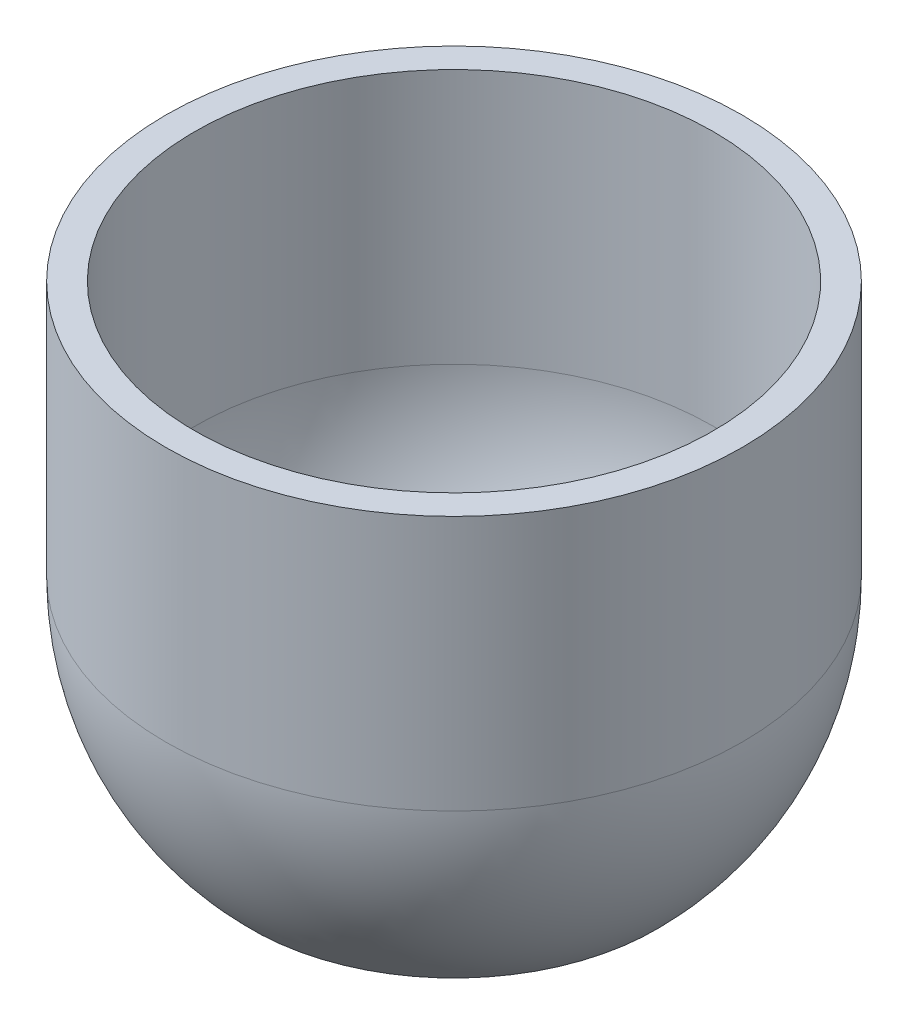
from build123d import *


with BuildPart() as part:
    # Sketch1 → Cup (revolve)
    with BuildSketch(Plane.XY, mode=Mode.PRIVATE) as cup_sk:
        with BuildLine():
            Line((0, 0), (35, 0))
            ThreePointArc((35, 0), (46.097722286, 16.342225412), (50, 35.707142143))
            Line((50, 35.707142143), (50, 80))
            Line((50, 80), (45, 80))
            Line((45, 80), (45, 35.707142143))
            ThreePointArc((45, 35.707142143), (41.864474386, 19.203633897), (32.894854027, 5))
            Line((32.894854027, 5), (0, 5))
            Line((0, 5), (0, 0))
        make_face()
    revolve(cup_sk.sketch.rotate(Axis((0, 0, 0), (0, 1, 0)), 90), axis=Axis((0, 0, 0), (0, 1, 0)))


solid = part.part
